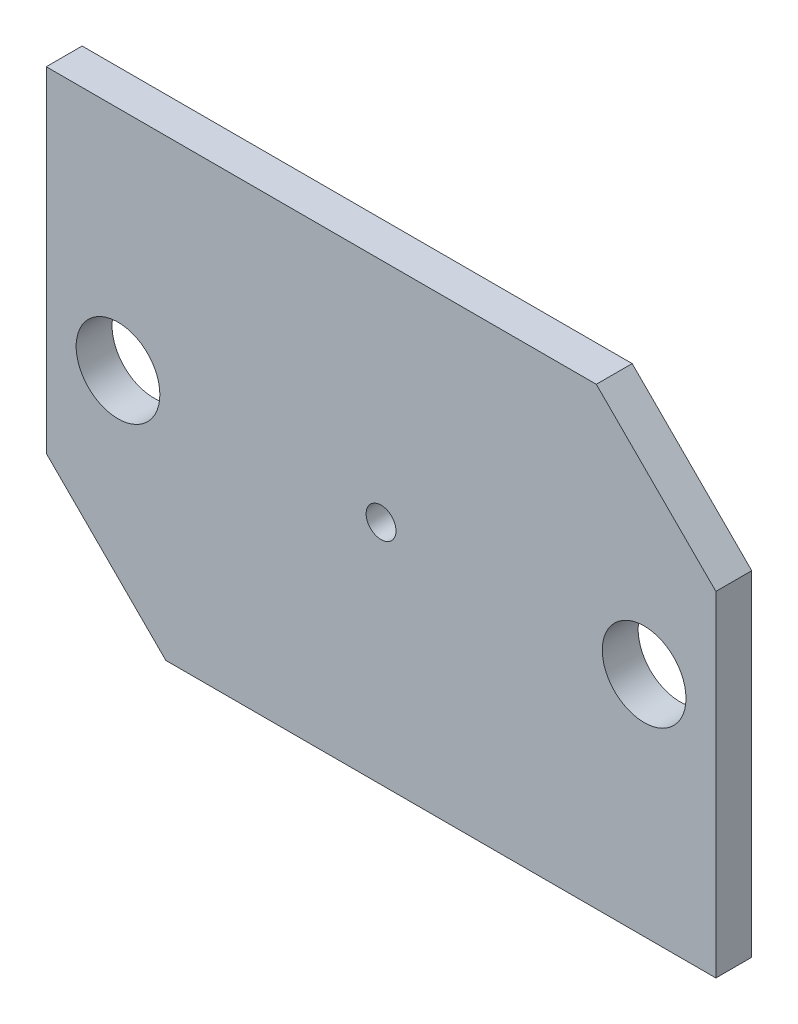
ISO-10303-21;
HEADER;
FILE_DESCRIPTION(('STEP AP214'),'2;1');
FILE_NAME('part.step','',(''),(''),'','','');
FILE_SCHEMA(('AUTOMOTIVE_DESIGN { 1 0 10303 214 1 1 1 1 }'));
ENDSEC;
DATA;
#1=APPLICATION_CONTEXT('core data for automotive mechanical design processes');
#2=APPLICATION_PROTOCOL_DEFINITION('international standard','automotive_design',2000,#1);
#3=PRODUCT_CONTEXT('',#1,'mechanical');
#4=PRODUCT('Part','Part','',(#3));
#5=PRODUCT_RELATED_PRODUCT_CATEGORY('part','',(#4));
#6=PRODUCT_DEFINITION_FORMATION('','',#4);
#7=PRODUCT_DEFINITION_CONTEXT('part definition',#1,'design');
#8=PRODUCT_DEFINITION('design','',#6,#7);
#9=PRODUCT_DEFINITION_SHAPE('','',#8);
#10=(LENGTH_UNIT() NAMED_UNIT(*) SI_UNIT(.MILLI.,.METRE.));
#11=(NAMED_UNIT(*) PLANE_ANGLE_UNIT() SI_UNIT($,.RADIAN.));
#12=(NAMED_UNIT(*) SI_UNIT($,.STERADIAN.) SOLID_ANGLE_UNIT());
#13=UNCERTAINTY_MEASURE_WITH_UNIT(LENGTH_MEASURE(1.E-05),#10,'distance_accuracy_value','');
#14=(GEOMETRIC_REPRESENTATION_CONTEXT(3) GLOBAL_UNCERTAINTY_ASSIGNED_CONTEXT((#13)) GLOBAL_UNIT_ASSIGNED_CONTEXT((#10,
#11,#12)) REPRESENTATION_CONTEXT('',''));
#15=CARTESIAN_POINT('',(0.,0.,0.));
#16=DIRECTION('',(0.,0.,1.));
#17=DIRECTION('',(1.,0.,0.));
#18=AXIS2_PLACEMENT_3D('',#15,#16,#17);
#19=CARTESIAN_POINT('',(-50.,-2.,3.));
#20=DIRECTION('',(0.,0.,-1.));
#21=DIRECTION('',(-1.,0.,0.));
#22=AXIS2_PLACEMENT_3D('',#19,#20,#21);
#23=PLANE('',#22);
#24=CARTESIAN_POINT('',(-44.,-21.,3.));
#25=DIRECTION('',(0.,0.,1.));
#26=DIRECTION('',(1.,0.,0.));
#27=AXIS2_PLACEMENT_3D('',#24,#25,#26);
#28=CIRCLE('',#27,3.5);
#29=CARTESIAN_POINT('',(-40.5,-21.,3.));
#30=VERTEX_POINT('',#29);
#31=EDGE_CURVE('E189',#30,#30,#28,.T.);
#32=ORIENTED_EDGE('',*,*,#31,.F.);
#33=EDGE_LOOP('',(#32));
#34=FACE_BOUND('',#33,.T.);
#35=DIRECTION('',(0.,1.,0.));
#36=VECTOR('',#35,1.);
#37=CARTESIAN_POINT('',(6.00000000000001,-40.,3.));
#38=LINE('',#37,#36);
#39=CARTESIAN_POINT('',(6.00000000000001,-40.,3.));
#40=VERTEX_POINT('',#39);
#41=CARTESIAN_POINT('',(6.,-12.0000000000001,3.));
#42=VERTEX_POINT('',#41);
#43=EDGE_CURVE('E107',#40,#42,#38,.T.);
#44=ORIENTED_EDGE('',*,*,#43,.T.);
#45=DIRECTION('',(0.707106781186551,-0.707106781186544,0.));
#46=VECTOR('',#45,1.);
#47=CARTESIAN_POINT('',(-4.00000000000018,-2.,3.));
#48=LINE('',#47,#46);
#49=CARTESIAN_POINT('',(-4.00000000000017,-2.,3.));
#50=VERTEX_POINT('',#49);
#51=EDGE_CURVE('E137',#42,#50,#48,.F.);
#52=ORIENTED_EDGE('',*,*,#51,.T.);
#53=DIRECTION('',(-1.,0.,0.));
#54=VECTOR('',#53,1.);
#55=CARTESIAN_POINT('',(-50.,-2.,3.));
#56=LINE('',#55,#54);
#57=CARTESIAN_POINT('',(-50.,-2.,3.));
#58=VERTEX_POINT('',#57);
#59=EDGE_CURVE('E125',#50,#58,#56,.T.);
#60=ORIENTED_EDGE('',*,*,#59,.T.);
#61=DIRECTION('',(0.,-1.,0.));
#62=VECTOR('',#61,1.);
#63=CARTESIAN_POINT('',(-50.,-40.,3.));
#64=LINE('',#63,#62);
#65=CARTESIAN_POINT('',(-50.,-29.9999999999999,3.));
#66=VERTEX_POINT('',#65);
#67=EDGE_CURVE('E117',#58,#66,#64,.T.);
#68=ORIENTED_EDGE('',*,*,#67,.T.);
#69=DIRECTION('',(-0.707106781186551,0.707106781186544,0.));
#70=VECTOR('',#69,1.);
#71=CARTESIAN_POINT('',(-39.9999999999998,-40.,3.));
#72=LINE('',#71,#70);
#73=CARTESIAN_POINT('',(-39.9999999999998,-40.,3.));
#74=VERTEX_POINT('',#73);
#75=EDGE_CURVE('E52',#66,#74,#72,.F.);
#76=ORIENTED_EDGE('',*,*,#75,.T.);
#77=DIRECTION('',(1.,0.,0.));
#78=VECTOR('',#77,1.);
#79=CARTESIAN_POINT('',(-50.,-40.,3.));
#80=LINE('',#79,#78);
#81=EDGE_CURVE('E122',#74,#40,#80,.T.);
#82=ORIENTED_EDGE('',*,*,#81,.T.);
#83=EDGE_LOOP('',(#44,#52,#60,#68,#76,#82));
#84=FACE_BOUND('',#83,.T.);
#85=CARTESIAN_POINT('',(-22.,-21.,3.));
#86=DIRECTION('',(0.,0.,1.));
#87=DIRECTION('',(1.,0.,0.));
#88=AXIS2_PLACEMENT_3D('',#85,#86,#87);
#89=CIRCLE('',#88,1.25);
#90=CARTESIAN_POINT('',(-20.75,-21.,3.));
#91=VERTEX_POINT('',#90);
#92=EDGE_CURVE('E182',#91,#91,#89,.T.);
#93=ORIENTED_EDGE('',*,*,#92,.F.);
#94=EDGE_LOOP('',(#93));
#95=FACE_BOUND('',#94,.T.);
#96=CARTESIAN_POINT('',(0.,-21.,3.));
#97=DIRECTION('',(0.,0.,1.));
#98=DIRECTION('',(1.,0.,0.));
#99=AXIS2_PLACEMENT_3D('',#96,#97,#98);
#100=CIRCLE('',#99,3.5);
#101=CARTESIAN_POINT('',(3.5,-21.,3.));
#102=VERTEX_POINT('',#101);
#103=EDGE_CURVE('E195',#102,#102,#100,.T.);
#104=ORIENTED_EDGE('',*,*,#103,.F.);
#105=EDGE_LOOP('',(#104));
#106=FACE_BOUND('',#105,.T.);
#107=ADVANCED_FACE('F37',(#34,#84,#95,#106),#23,.F.);
#108=CARTESIAN_POINT('',(-50.,-2.,0.));
#109=DIRECTION('',(0.,0.,-1.));
#110=DIRECTION('',(-1.,0.,0.));
#111=AXIS2_PLACEMENT_3D('',#108,#109,#110);
#112=PLANE('',#111);
#113=CARTESIAN_POINT('',(-44.,-21.,0.));
#114=DIRECTION('',(0.,0.,1.));
#115=DIRECTION('',(1.,0.,0.));
#116=AXIS2_PLACEMENT_3D('',#113,#114,#115);
#117=CIRCLE('',#116,3.5);
#118=CARTESIAN_POINT('',(-40.5,-21.,0.));
#119=VERTEX_POINT('',#118);
#120=EDGE_CURVE('E192',#119,#119,#117,.T.);
#121=ORIENTED_EDGE('',*,*,#120,.T.);
#122=EDGE_LOOP('',(#121));
#123=FACE_BOUND('',#122,.T.);
#124=DIRECTION('',(-1.,0.,0.));
#125=VECTOR('',#124,1.);
#126=CARTESIAN_POINT('',(-50.,-2.,0.));
#127=LINE('',#126,#125);
#128=CARTESIAN_POINT('',(-4.00000000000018,-2.,0.));
#129=VERTEX_POINT('',#128);
#130=CARTESIAN_POINT('',(-50.,-2.,0.));
#131=VERTEX_POINT('',#130);
#132=EDGE_CURVE('E115',#129,#131,#127,.T.);
#133=ORIENTED_EDGE('',*,*,#132,.F.);
#134=DIRECTION('',(-0.707106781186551,0.707106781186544,0.));
#135=VECTOR('',#134,1.);
#136=CARTESIAN_POINT('',(-27.0000000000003,20.9999999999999,0.));
#137=LINE('',#136,#135);
#138=CARTESIAN_POINT('',(6.,-12.0000000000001,0.));
#139=VERTEX_POINT('',#138);
#140=EDGE_CURVE('E114',#129,#139,#137,.F.);
#141=ORIENTED_EDGE('',*,*,#140,.T.);
#142=DIRECTION('',(0.,1.,0.));
#143=VECTOR('',#142,1.);
#144=CARTESIAN_POINT('',(6.00000000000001,-40.,0.));
#145=LINE('',#144,#143);
#146=CARTESIAN_POINT('',(6.00000000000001,-40.,0.));
#147=VERTEX_POINT('',#146);
#148=EDGE_CURVE('E99',#147,#139,#145,.T.);
#149=ORIENTED_EDGE('',*,*,#148,.F.);
#150=DIRECTION('',(1.,0.,0.));
#151=VECTOR('',#150,1.);
#152=CARTESIAN_POINT('',(-50.,-40.,0.));
#153=LINE('',#152,#151);
#154=CARTESIAN_POINT('',(-39.9999999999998,-40.,0.));
#155=VERTEX_POINT('',#154);
#156=EDGE_CURVE('E91',#155,#147,#153,.T.);
#157=ORIENTED_EDGE('',*,*,#156,.F.);
#158=DIRECTION('',(0.707106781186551,-0.707106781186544,0.));
#159=VECTOR('',#158,1.);
#160=CARTESIAN_POINT('',(-64.,-16.0000000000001,0.));
#161=LINE('',#160,#159);
#162=CARTESIAN_POINT('',(-50.,-29.9999999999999,0.));
#163=VERTEX_POINT('',#162);
#164=EDGE_CURVE('E131',#155,#163,#161,.F.);
#165=ORIENTED_EDGE('',*,*,#164,.T.);
#166=DIRECTION('',(0.,-1.,0.));
#167=VECTOR('',#166,1.);
#168=CARTESIAN_POINT('',(-50.,-40.,0.));
#169=LINE('',#168,#167);
#170=EDGE_CURVE('E100',#131,#163,#169,.T.);
#171=ORIENTED_EDGE('',*,*,#170,.F.);
#172=EDGE_LOOP('',(#133,#141,#149,#157,#165,#171));
#173=FACE_BOUND('',#172,.T.);
#174=CARTESIAN_POINT('',(-22.,-21.,0.));
#175=DIRECTION('',(0.,0.,1.));
#176=DIRECTION('',(1.,0.,0.));
#177=AXIS2_PLACEMENT_3D('',#174,#175,#176);
#178=CIRCLE('',#177,1.25);
#179=CARTESIAN_POINT('',(-20.75,-21.,0.));
#180=VERTEX_POINT('',#179);
#181=EDGE_CURVE('E184',#180,#180,#178,.T.);
#182=ORIENTED_EDGE('',*,*,#181,.T.);
#183=EDGE_LOOP('',(#182));
#184=FACE_BOUND('',#183,.T.);
#185=CARTESIAN_POINT('',(0.,-21.,0.));
#186=DIRECTION('',(0.,0.,1.));
#187=DIRECTION('',(1.,0.,0.));
#188=AXIS2_PLACEMENT_3D('',#185,#186,#187);
#189=CIRCLE('',#188,3.5);
#190=CARTESIAN_POINT('',(3.5,-21.,0.));
#191=VERTEX_POINT('',#190);
#192=EDGE_CURVE('E198',#191,#191,#189,.T.);
#193=ORIENTED_EDGE('',*,*,#192,.T.);
#194=EDGE_LOOP('',(#193));
#195=FACE_BOUND('',#194,.T.);
#196=ADVANCED_FACE('F112',(#123,#173,#184,#195),#112,.T.);
#197=CARTESIAN_POINT('',(-50.,-40.,3.));
#198=DIRECTION('',(1.,0.,0.));
#199=DIRECTION('',(0.,0.,-1.));
#200=AXIS2_PLACEMENT_3D('',#197,#198,#199);
#201=PLANE('',#200);
#202=ORIENTED_EDGE('',*,*,#170,.T.);
#203=DIRECTION('',(0.,0.,1.));
#204=VECTOR('',#203,1.);
#205=CARTESIAN_POINT('',(-50.,-29.9999999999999,3.));
#206=LINE('',#205,#204);
#207=EDGE_CURVE('E11',#163,#66,#206,.T.);
#208=ORIENTED_EDGE('',*,*,#207,.T.);
#209=ORIENTED_EDGE('',*,*,#67,.F.);
#210=DIRECTION('',(0.,0.,-1.));
#211=VECTOR('',#210,1.);
#212=CARTESIAN_POINT('',(-50.,-2.,3.));
#213=LINE('',#212,#211);
#214=EDGE_CURVE('E109',#58,#131,#213,.T.);
#215=ORIENTED_EDGE('',*,*,#214,.T.);
#216=EDGE_LOOP('',(#202,#208,#209,#215));
#217=FACE_BOUND('',#216,.T.);
#218=ADVANCED_FACE('F39',(#217),#201,.F.);
#219=CARTESIAN_POINT('',(-50.,-40.,3.));
#220=DIRECTION('',(0.,1.,0.));
#221=DIRECTION('',(0.,0.,1.));
#222=AXIS2_PLACEMENT_3D('',#219,#220,#221);
#223=PLANE('',#222);
#224=ORIENTED_EDGE('',*,*,#81,.F.);
#225=DIRECTION('',(0.,0.,-1.));
#226=VECTOR('',#225,1.);
#227=CARTESIAN_POINT('',(-39.9999999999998,-40.,3.));
#228=LINE('',#227,#226);
#229=EDGE_CURVE('E45',#74,#155,#228,.T.);
#230=ORIENTED_EDGE('',*,*,#229,.T.);
#231=ORIENTED_EDGE('',*,*,#156,.T.);
#232=DIRECTION('',(0.,0.,-1.));
#233=VECTOR('',#232,1.);
#234=CARTESIAN_POINT('',(6.00000000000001,-40.,3.));
#235=LINE('',#234,#233);
#236=EDGE_CURVE('E94',#40,#147,#235,.T.);
#237=ORIENTED_EDGE('',*,*,#236,.F.);
#238=EDGE_LOOP('',(#224,#230,#231,#237));
#239=FACE_BOUND('',#238,.T.);
#240=ADVANCED_FACE('F93',(#239),#223,.F.);
#241=CARTESIAN_POINT('',(6.00000000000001,-40.,3.));
#242=DIRECTION('',(-1.,0.,0.));
#243=DIRECTION('',(0.,-1.,0.));
#244=AXIS2_PLACEMENT_3D('',#241,#242,#243);
#245=PLANE('',#244);
#246=ORIENTED_EDGE('',*,*,#148,.T.);
#247=DIRECTION('',(0.,0.,1.));
#248=VECTOR('',#247,1.);
#249=CARTESIAN_POINT('',(6.,-12.0000000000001,3.));
#250=LINE('',#249,#248);
#251=EDGE_CURVE('E134',#139,#42,#250,.T.);
#252=ORIENTED_EDGE('',*,*,#251,.T.);
#253=ORIENTED_EDGE('',*,*,#43,.F.);
#254=ORIENTED_EDGE('',*,*,#236,.T.);
#255=EDGE_LOOP('',(#246,#252,#253,#254));
#256=FACE_BOUND('',#255,.T.);
#257=ADVANCED_FACE('F104',(#256),#245,.F.);
#258=CARTESIAN_POINT('',(-50.,-2.,3.));
#259=DIRECTION('',(0.,-1.,0.));
#260=DIRECTION('',(0.,0.,-1.));
#261=AXIS2_PLACEMENT_3D('',#258,#259,#260);
#262=PLANE('',#261);
#263=ORIENTED_EDGE('',*,*,#59,.F.);
#264=DIRECTION('',(0.,0.,-1.));
#265=VECTOR('',#264,1.);
#266=CARTESIAN_POINT('',(-4.00000000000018,-2.,3.));
#267=LINE('',#266,#265);
#268=EDGE_CURVE('E108',#50,#129,#267,.T.);
#269=ORIENTED_EDGE('',*,*,#268,.T.);
#270=ORIENTED_EDGE('',*,*,#132,.T.);
#271=ORIENTED_EDGE('',*,*,#214,.F.);
#272=EDGE_LOOP('',(#263,#269,#270,#271));
#273=FACE_BOUND('',#272,.T.);
#274=ADVANCED_FACE('F145',(#273),#262,.F.);
#275=CARTESIAN_POINT('',(-22.,-21.,3.));
#276=DIRECTION('',(0.,0.,-1.));
#277=DIRECTION('',(-1.,0.,0.));
#278=AXIS2_PLACEMENT_3D('',#275,#276,#277);
#279=CYLINDRICAL_SURFACE('',#278,1.25);
#280=ORIENTED_EDGE('',*,*,#92,.T.);
#281=EDGE_LOOP('',(#280));
#282=FACE_BOUND('',#281,.T.);
#283=ORIENTED_EDGE('',*,*,#181,.F.);
#284=EDGE_LOOP('',(#283));
#285=FACE_BOUND('',#284,.T.);
#286=ADVANCED_FACE('F173',(#282,#285),#279,.F.);
#287=CARTESIAN_POINT('',(-44.,-21.,3.));
#288=DIRECTION('',(0.,0.,-1.));
#289=DIRECTION('',(-1.,0.,0.));
#290=AXIS2_PLACEMENT_3D('',#287,#288,#289);
#291=CYLINDRICAL_SURFACE('',#290,3.5);
#292=ORIENTED_EDGE('',*,*,#31,.T.);
#293=EDGE_LOOP('',(#292));
#294=FACE_BOUND('',#293,.T.);
#295=ORIENTED_EDGE('',*,*,#120,.F.);
#296=EDGE_LOOP('',(#295));
#297=FACE_BOUND('',#296,.T.);
#298=ADVANCED_FACE('F157',(#294,#297),#291,.F.);
#299=CARTESIAN_POINT('',(0.,-21.,3.));
#300=DIRECTION('',(0.,0.,-1.));
#301=DIRECTION('',(-1.,0.,0.));
#302=AXIS2_PLACEMENT_3D('',#299,#300,#301);
#303=CYLINDRICAL_SURFACE('',#302,3.5);
#304=ORIENTED_EDGE('',*,*,#103,.T.);
#305=EDGE_LOOP('',(#304));
#306=FACE_BOUND('',#305,.T.);
#307=ORIENTED_EDGE('',*,*,#192,.F.);
#308=EDGE_LOOP('',(#307));
#309=FACE_BOUND('',#308,.T.);
#310=ADVANCED_FACE('F149',(#306,#309),#303,.F.);
#311=CARTESIAN_POINT('',(-4.00000000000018,-2.,3.));
#312=DIRECTION('',(-0.707106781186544,-0.707106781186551,0.));
#313=DIRECTION('',(0.707106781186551,-0.707106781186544,0.));
#314=AXIS2_PLACEMENT_3D('',#311,#312,#313);
#315=PLANE('',#314);
#316=ORIENTED_EDGE('',*,*,#51,.F.);
#317=ORIENTED_EDGE('',*,*,#251,.F.);
#318=ORIENTED_EDGE('',*,*,#140,.F.);
#319=ORIENTED_EDGE('',*,*,#268,.F.);
#320=EDGE_LOOP('',(#316,#317,#318,#319));
#321=FACE_BOUND('',#320,.T.);
#322=ADVANCED_FACE('F146',(#321),#315,.F.);
#323=CARTESIAN_POINT('',(-39.9999999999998,-40.,3.));
#324=DIRECTION('',(0.707106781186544,0.707106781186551,0.));
#325=DIRECTION('',(-0.707106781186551,0.707106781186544,0.));
#326=AXIS2_PLACEMENT_3D('',#323,#324,#325);
#327=PLANE('',#326);
#328=ORIENTED_EDGE('',*,*,#75,.F.);
#329=ORIENTED_EDGE('',*,*,#207,.F.);
#330=ORIENTED_EDGE('',*,*,#164,.F.);
#331=ORIENTED_EDGE('',*,*,#229,.F.);
#332=EDGE_LOOP('',(#328,#329,#330,#331));
#333=FACE_BOUND('',#332,.T.);
#334=ADVANCED_FACE('F148',(#333),#327,.F.);
#335=CLOSED_SHELL('',(#107,#196,#218,#240,#257,#274,#286,#298,#310,#322,#334));
#336=MANIFOLD_SOLID_BREP('B2',#335);
#337=ADVANCED_BREP_SHAPE_REPRESENTATION('',(#18,#336),#14);
#338=SHAPE_DEFINITION_REPRESENTATION(#9,#337);
ENDSEC;
END-ISO-10303-21;
